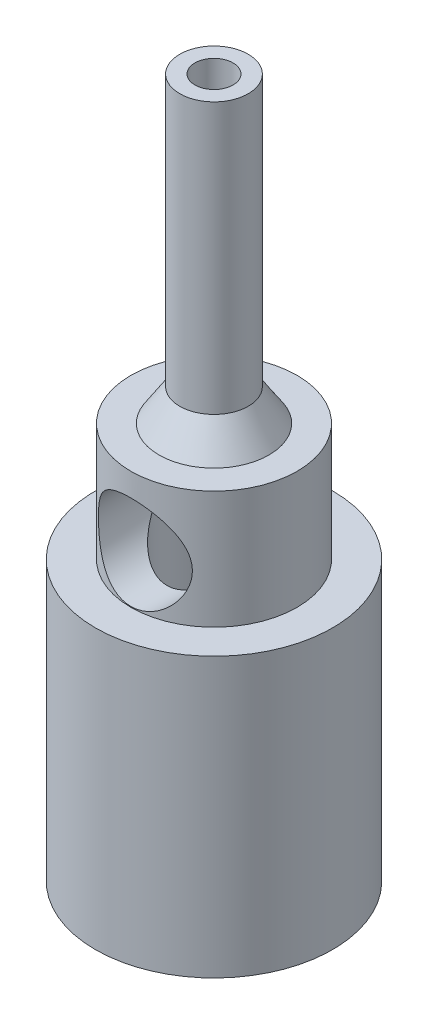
ISO-10303-21;
HEADER;
FILE_DESCRIPTION(('STEP AP214'),'2;1');
FILE_NAME('part.step','',(''),(''),'','','');
FILE_SCHEMA(('AUTOMOTIVE_DESIGN { 1 0 10303 214 1 1 1 1 }'));
ENDSEC;
DATA;
#1=APPLICATION_CONTEXT('core data for automotive mechanical design processes');
#2=APPLICATION_PROTOCOL_DEFINITION('international standard','automotive_design',2000,#1);
#3=PRODUCT_CONTEXT('',#1,'mechanical');
#4=PRODUCT('Part','Part','',(#3));
#5=PRODUCT_RELATED_PRODUCT_CATEGORY('part','',(#4));
#6=PRODUCT_DEFINITION_FORMATION('','',#4);
#7=PRODUCT_DEFINITION_CONTEXT('part definition',#1,'design');
#8=PRODUCT_DEFINITION('design','',#6,#7);
#9=PRODUCT_DEFINITION_SHAPE('','',#8);
#10=(LENGTH_UNIT() NAMED_UNIT(*) SI_UNIT(.MILLI.,.METRE.));
#11=(NAMED_UNIT(*) PLANE_ANGLE_UNIT() SI_UNIT($,.RADIAN.));
#12=(NAMED_UNIT(*) SI_UNIT($,.STERADIAN.) SOLID_ANGLE_UNIT());
#13=UNCERTAINTY_MEASURE_WITH_UNIT(LENGTH_MEASURE(1.E-05),#10,'distance_accuracy_value','');
#14=(GEOMETRIC_REPRESENTATION_CONTEXT(3) GLOBAL_UNCERTAINTY_ASSIGNED_CONTEXT((#13)) GLOBAL_UNIT_ASSIGNED_CONTEXT((#10,
#11,#12)) REPRESENTATION_CONTEXT('',''));
#15=CARTESIAN_POINT('',(0.,0.,0.));
#16=DIRECTION('',(0.,0.,1.));
#17=DIRECTION('',(1.,0.,0.));
#18=AXIS2_PLACEMENT_3D('',#15,#16,#17);
#19=CARTESIAN_POINT('',(1.2,43.9,0.));
#20=DIRECTION('',(0.,-1.,0.));
#21=DIRECTION('',(0.,0.,-1.));
#22=AXIS2_PLACEMENT_3D('',#19,#20,#21);
#23=PLANE('',#22);
#24=CARTESIAN_POINT('',(0.,43.9,0.));
#25=DIRECTION('',(0.,1.,0.));
#26=DIRECTION('',(0.,0.,1.));
#27=AXIS2_PLACEMENT_3D('',#24,#25,#26);
#28=CIRCLE('',#27,1.2);
#29=CARTESIAN_POINT('',(0.,43.9,1.2));
#30=VERTEX_POINT('',#29);
#31=EDGE_CURVE('E11',#30,#30,#28,.T.);
#32=ORIENTED_EDGE('',*,*,#31,.F.);
#33=EDGE_LOOP('',(#32));
#34=FACE_BOUND('',#33,.T.);
#35=CARTESIAN_POINT('',(0.,43.9,0.));
#36=DIRECTION('',(0.,1.,0.));
#37=DIRECTION('',(0.,0.,1.));
#38=AXIS2_PLACEMENT_3D('',#35,#36,#37);
#39=CIRCLE('',#38,2.15);
#40=CARTESIAN_POINT('',(0.,43.9,2.15));
#41=VERTEX_POINT('',#40);
#42=EDGE_CURVE('E67',#41,#41,#39,.T.);
#43=ORIENTED_EDGE('',*,*,#42,.T.);
#44=EDGE_LOOP('',(#43));
#45=FACE_BOUND('',#44,.T.);
#46=ADVANCED_FACE('F31',(#34,#45),#23,.F.);
#47=CARTESIAN_POINT('',(0.,37.9536023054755,0.));
#48=DIRECTION('',(0.,1.,0.));
#49=DIRECTION('',(0.,0.,1.));
#50=AXIS2_PLACEMENT_3D('',#47,#48,#49);
#51=CYLINDRICAL_SURFACE('',#50,1.2);
#52=CARTESIAN_POINT('',(0.,22.8366133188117,0.));
#53=DIRECTION('',(0.,1.,0.));
#54=DIRECTION('',(0.,0.,1.));
#55=AXIS2_PLACEMENT_3D('',#52,#53,#54);
#56=CIRCLE('',#55,1.2);
#57=CARTESIAN_POINT('',(0.,22.8366133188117,1.2));
#58=VERTEX_POINT('',#57);
#59=EDGE_CURVE('E116',#58,#58,#56,.T.);
#60=ORIENTED_EDGE('',*,*,#59,.F.);
#61=EDGE_LOOP('',(#60));
#62=FACE_BOUND('',#61,.T.);
#63=ORIENTED_EDGE('',*,*,#31,.T.);
#64=EDGE_LOOP('',(#63));
#65=FACE_BOUND('',#64,.T.);
#66=ADVANCED_FACE('F146',(#62,#65),#51,.F.);
#67=CARTESIAN_POINT('',(0.,37.9536023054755,0.));
#68=DIRECTION('',(0.,1.,0.));
#69=DIRECTION('',(0.,0.,1.));
#70=AXIS2_PLACEMENT_3D('',#67,#68,#69);
#71=CYLINDRICAL_SURFACE('',#70,2.95000000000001);
#72=CARTESIAN_POINT('',(0.,20.5,0.));
#73=DIRECTION('',(0.,0.707106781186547,-0.707106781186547));
#74=DIRECTION('',(0.,0.707106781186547,0.707106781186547));
#75=AXIS2_PLACEMENT_3D('',#72,#73,#74);
#76=ELLIPSE('',#75,4.17193000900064,2.95);
#77=CARTESIAN_POINT('',(2.95,20.5,0.));
#78=VERTEX_POINT('',#77);
#79=CARTESIAN_POINT('',(-2.95,20.5,0.));
#80=VERTEX_POINT('',#79);
#81=EDGE_CURVE('E56',#78,#80,#76,.T.);
#82=ORIENTED_EDGE('',*,*,#81,.T.);
#83=CARTESIAN_POINT('',(0.,20.5,0.));
#84=DIRECTION('',(0.,0.707106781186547,0.707106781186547));
#85=DIRECTION('',(0.,0.707106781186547,-0.707106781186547));
#86=AXIS2_PLACEMENT_3D('',#83,#84,#85);
#87=ELLIPSE('',#86,4.17193000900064,2.95);
#88=EDGE_CURVE('E61',#80,#78,#87,.T.);
#89=ORIENTED_EDGE('',*,*,#88,.T.);
#90=EDGE_LOOP('',(#82,#89));
#91=FACE_BOUND('',#90,.T.);
#92=CARTESIAN_POINT('',(0.,0.,0.));
#93=DIRECTION('',(0.,1.,0.));
#94=DIRECTION('',(0.,0.,1.));
#95=AXIS2_PLACEMENT_3D('',#92,#93,#94);
#96=CIRCLE('',#95,2.95000000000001);
#97=CARTESIAN_POINT('',(0.,0.,2.95000000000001));
#98=VERTEX_POINT('',#97);
#99=EDGE_CURVE('E105',#98,#98,#96,.T.);
#100=ORIENTED_EDGE('',*,*,#99,.F.);
#101=EDGE_LOOP('',(#100));
#102=FACE_BOUND('',#101,.T.);
#103=ADVANCED_FACE('F69',(#91,#102),#71,.F.);
#104=CARTESIAN_POINT('',(2.95000000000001,0.,0.));
#105=DIRECTION('',(0.,1.,0.));
#106=DIRECTION('',(0.,0.,1.));
#107=AXIS2_PLACEMENT_3D('',#104,#105,#106);
#108=PLANE('',#107);
#109=CARTESIAN_POINT('',(0.,0.,0.));
#110=DIRECTION('',(0.,1.,0.));
#111=DIRECTION('',(0.,0.,1.));
#112=AXIS2_PLACEMENT_3D('',#109,#110,#111);
#113=CIRCLE('',#112,3.45);
#114=CARTESIAN_POINT('',(0.,0.,3.45));
#115=VERTEX_POINT('',#114);
#116=EDGE_CURVE('E102',#115,#115,#113,.T.);
#117=ORIENTED_EDGE('',*,*,#116,.F.);
#118=EDGE_LOOP('',(#117));
#119=FACE_BOUND('',#118,.T.);
#120=ORIENTED_EDGE('',*,*,#99,.T.);
#121=EDGE_LOOP('',(#120));
#122=FACE_BOUND('',#121,.T.);
#123=ADVANCED_FACE('F162',(#119,#122),#108,.F.);
#124=CARTESIAN_POINT('',(0.,0.,0.));
#125=DIRECTION('',(0.,1.,0.));
#126=DIRECTION('',(0.,0.,1.));
#127=AXIS2_PLACEMENT_3D('',#124,#125,#126);
#128=CONICAL_SURFACE('',#127,3.45,0.785398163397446);
#129=CARTESIAN_POINT('',(0.,0.699999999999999,0.));
#130=DIRECTION('',(0.,1.,0.));
#131=DIRECTION('',(0.,0.,1.));
#132=AXIS2_PLACEMENT_3D('',#129,#130,#131);
#133=CIRCLE('',#132,4.15);
#134=CARTESIAN_POINT('',(0.,0.699999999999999,4.15));
#135=VERTEX_POINT('',#134);
#136=EDGE_CURVE('E99',#135,#135,#133,.T.);
#137=ORIENTED_EDGE('',*,*,#136,.F.);
#138=EDGE_LOOP('',(#137));
#139=FACE_BOUND('',#138,.T.);
#140=ORIENTED_EDGE('',*,*,#116,.T.);
#141=EDGE_LOOP('',(#140));
#142=FACE_BOUND('',#141,.T.);
#143=ADVANCED_FACE('F176',(#139,#142),#128,.T.);
#144=CARTESIAN_POINT('',(4.15,0.7,0.));
#145=DIRECTION('',(0.,1.,0.));
#146=DIRECTION('',(0.,0.,1.));
#147=AXIS2_PLACEMENT_3D('',#144,#145,#146);
#148=PLANE('',#147);
#149=CARTESIAN_POINT('',(0.,0.699999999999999,0.));
#150=DIRECTION('',(0.,1.,0.));
#151=DIRECTION('',(0.,0.,1.));
#152=AXIS2_PLACEMENT_3D('',#149,#150,#151);
#153=CIRCLE('',#152,6.1);
#154=CARTESIAN_POINT('',(0.,0.699999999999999,6.1));
#155=VERTEX_POINT('',#154);
#156=EDGE_CURVE('E96',#155,#155,#153,.T.);
#157=ORIENTED_EDGE('',*,*,#156,.F.);
#158=EDGE_LOOP('',(#157));
#159=FACE_BOUND('',#158,.T.);
#160=ORIENTED_EDGE('',*,*,#136,.T.);
#161=EDGE_LOOP('',(#160));
#162=FACE_BOUND('',#161,.T.);
#163=ADVANCED_FACE('F180',(#159,#162),#148,.F.);
#164=CARTESIAN_POINT('',(0.,37.9536023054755,0.));
#165=DIRECTION('',(0.,1.,0.));
#166=DIRECTION('',(0.,0.,1.));
#167=AXIS2_PLACEMENT_3D('',#164,#165,#166);
#168=CYLINDRICAL_SURFACE('',#167,6.1);
#169=CARTESIAN_POINT('',(0.,0.,0.));
#170=DIRECTION('',(0.,1.,0.));
#171=DIRECTION('',(0.,0.,1.));
#172=AXIS2_PLACEMENT_3D('',#169,#170,#171);
#173=CIRCLE('',#172,6.1);
#174=CARTESIAN_POINT('',(0.,0.,6.1));
#175=VERTEX_POINT('',#174);
#176=EDGE_CURVE('E93',#175,#175,#173,.T.);
#177=ORIENTED_EDGE('',*,*,#176,.F.);
#178=EDGE_LOOP('',(#177));
#179=FACE_BOUND('',#178,.T.);
#180=ORIENTED_EDGE('',*,*,#156,.T.);
#181=EDGE_LOOP('',(#180));
#182=FACE_BOUND('',#181,.T.);
#183=ADVANCED_FACE('F184',(#179,#182),#168,.F.);
#184=CARTESIAN_POINT('',(6.1,0.,0.));
#185=DIRECTION('',(0.,1.,0.));
#186=DIRECTION('',(0.,0.,1.));
#187=AXIS2_PLACEMENT_3D('',#184,#185,#186);
#188=PLANE('',#187);
#189=CARTESIAN_POINT('',(0.,0.,0.));
#190=DIRECTION('',(0.,1.,0.));
#191=DIRECTION('',(0.,0.,1.));
#192=AXIS2_PLACEMENT_3D('',#189,#190,#191);
#193=CIRCLE('',#192,7.45);
#194=CARTESIAN_POINT('',(0.,0.,7.45));
#195=VERTEX_POINT('',#194);
#196=EDGE_CURVE('E90',#195,#195,#193,.T.);
#197=ORIENTED_EDGE('',*,*,#196,.F.);
#198=EDGE_LOOP('',(#197));
#199=FACE_BOUND('',#198,.T.);
#200=ORIENTED_EDGE('',*,*,#176,.T.);
#201=EDGE_LOOP('',(#200));
#202=FACE_BOUND('',#201,.T.);
#203=ADVANCED_FACE('F188',(#199,#202),#188,.F.);
#204=CARTESIAN_POINT('',(0.,37.9536023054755,0.));
#205=DIRECTION('',(0.,1.,0.));
#206=DIRECTION('',(0.,0.,1.));
#207=AXIS2_PLACEMENT_3D('',#204,#205,#206);
#208=CYLINDRICAL_SURFACE('',#207,7.45);
#209=CARTESIAN_POINT('',(0.,17.5,0.));
#210=DIRECTION('',(0.,1.,0.));
#211=DIRECTION('',(0.,0.,1.));
#212=AXIS2_PLACEMENT_3D('',#209,#210,#211);
#213=CIRCLE('',#212,7.45);
#214=CARTESIAN_POINT('',(0.,17.5,7.45));
#215=VERTEX_POINT('',#214);
#216=EDGE_CURVE('E87',#215,#215,#213,.T.);
#217=ORIENTED_EDGE('',*,*,#216,.F.);
#218=EDGE_LOOP('',(#217));
#219=FACE_BOUND('',#218,.T.);
#220=ORIENTED_EDGE('',*,*,#196,.T.);
#221=EDGE_LOOP('',(#220));
#222=FACE_BOUND('',#221,.T.);
#223=ADVANCED_FACE('F192',(#219,#222),#208,.T.);
#224=CARTESIAN_POINT('',(5.22,17.5,0.));
#225=DIRECTION('',(0.,-1.,0.));
#226=DIRECTION('',(0.,0.,-1.));
#227=AXIS2_PLACEMENT_3D('',#224,#225,#226);
#228=PLANE('',#227);
#229=CARTESIAN_POINT('',(0.,17.5,0.));
#230=DIRECTION('',(0.,1.,0.));
#231=DIRECTION('',(0.,0.,1.));
#232=AXIS2_PLACEMENT_3D('',#229,#230,#231);
#233=CIRCLE('',#232,5.22);
#234=CARTESIAN_POINT('',(0.,17.5,5.22));
#235=VERTEX_POINT('',#234);
#236=EDGE_CURVE('E84',#235,#235,#233,.T.);
#237=ORIENTED_EDGE('',*,*,#236,.F.);
#238=EDGE_LOOP('',(#237));
#239=FACE_BOUND('',#238,.T.);
#240=ORIENTED_EDGE('',*,*,#216,.T.);
#241=EDGE_LOOP('',(#240));
#242=FACE_BOUND('',#241,.T.);
#243=ADVANCED_FACE('F141',(#239,#242),#228,.F.);
#244=CARTESIAN_POINT('',(0.,37.9536023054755,0.));
#245=DIRECTION('',(0.,1.,0.));
#246=DIRECTION('',(0.,0.,1.));
#247=AXIS2_PLACEMENT_3D('',#244,#245,#246);
#248=CYLINDRICAL_SURFACE('',#247,5.22);
#249=CARTESIAN_POINT('',(0.,17.55,5.22));
#250=CARTESIAN_POINT('',(-0.152626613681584,17.5500123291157,5.21998911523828));
#251=CARTESIAN_POINT('',(-0.30539885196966,17.5619173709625,5.21323641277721));
#252=CARTESIAN_POINT('',(-0.606072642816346,17.6089129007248,5.18689915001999));
#253=CARTESIAN_POINT('',(-0.753973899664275,17.6440047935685,5.16731381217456));
#254=CARTESIAN_POINT('',(-1.04042041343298,17.7354837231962,5.11732275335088));
#255=CARTESIAN_POINT('',(-1.17899806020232,17.7917920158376,5.08695706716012));
#256=CARTESIAN_POINT('',(-1.44445684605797,17.9235618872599,5.01804587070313));
#257=CARTESIAN_POINT('',(-1.57133506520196,17.9990282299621,4.97949832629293));
#258=CARTESIAN_POINT('',(-1.81990569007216,18.1729706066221,4.8943644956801));
#259=CARTESIAN_POINT('',(-1.94058945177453,18.2727003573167,4.84740168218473));
#260=CARTESIAN_POINT('',(-2.16448883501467,18.4895723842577,4.75165724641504));
#261=CARTESIAN_POINT('',(-2.2676858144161,18.6067329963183,4.70287374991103));
#262=CARTESIAN_POINT('',(-2.46471555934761,18.8698239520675,4.60293613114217));
#263=CARTESIAN_POINT('',(-2.55640355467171,19.0174865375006,4.55207697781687));
#264=CARTESIAN_POINT('',(-2.71325547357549,19.3290828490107,4.4603751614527));
#265=CARTESIAN_POINT('',(-2.77845858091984,19.4929920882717,4.41951773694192));
#266=CARTESIAN_POINT('',(-2.86813026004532,19.7960119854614,4.36170074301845));
#267=CARTESIAN_POINT('',(-2.89836583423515,19.9327932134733,4.34148028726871));
#268=CARTESIAN_POINT('',(-2.93910229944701,20.2104886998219,4.31401309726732));
#269=CARTESIAN_POINT('',(-2.94962362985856,20.3513985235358,4.30675292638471));
#270=CARTESIAN_POINT('',(-2.95035696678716,20.6334687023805,4.30625055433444));
#271=CARTESIAN_POINT('',(-2.94054351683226,20.774629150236,4.31302592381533));
#272=CARTESIAN_POINT('',(-2.90113096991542,21.052920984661,4.33962911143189));
#273=CARTESIAN_POINT('',(-2.87151857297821,21.1900495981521,4.35946570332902));
#274=CARTESIAN_POINT('',(-2.79403322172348,21.4566206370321,4.40952072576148));
#275=CARTESIAN_POINT('',(-2.7461999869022,21.5860790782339,4.43971656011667));
#276=CARTESIAN_POINT('',(-2.63392433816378,21.8355448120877,4.50723053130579));
#277=CARTESIAN_POINT('',(-2.56947550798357,21.9555484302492,4.54455141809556));
#278=CARTESIAN_POINT('',(-2.41408957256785,22.2026992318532,4.6292066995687));
#279=CARTESIAN_POINT('',(-2.32058257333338,22.3280107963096,4.67719333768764));
#280=CARTESIAN_POINT('',(-2.11510103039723,22.5623247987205,4.77364318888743));
#281=CARTESIAN_POINT('',(-2.00311120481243,22.6713135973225,4.82210676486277));
#282=CARTESIAN_POINT('',(-1.74907553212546,22.8818575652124,4.92031968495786));
#283=CARTESIAN_POINT('',(-1.60508529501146,22.9813139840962,4.96963528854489));
#284=CARTESIAN_POINT('',(-1.37603565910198,23.1108909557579,5.03599990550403));
#285=CARTESIAN_POINT('',(-1.29747537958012,23.150827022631,5.05685992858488));
#286=CARTESIAN_POINT('',(-1.13647009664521,23.2237343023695,5.09545554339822));
#287=CARTESIAN_POINT('',(-1.0540274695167,23.256709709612,5.11319301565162));
#288=CARTESIAN_POINT('',(-0.891711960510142,23.3132216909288,5.14388905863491));
#289=CARTESIAN_POINT('',(-0.812058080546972,23.3372546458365,5.15709392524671));
#290=CARTESIAN_POINT('',(-0.650559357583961,23.3785786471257,5.179943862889));
#291=CARTESIAN_POINT('',(-0.568715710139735,23.3958732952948,5.18959083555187));
#292=CARTESIAN_POINT('',(-0.40353614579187,23.4234674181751,5.20503885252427));
#293=CARTESIAN_POINT('',(-0.320201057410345,23.4337706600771,5.21084196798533));
#294=CARTESIAN_POINT('',(-0.152803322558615,23.4472383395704,5.21843733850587));
#295=CARTESIAN_POINT('',(-0.0687407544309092,23.4504035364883,5.22023002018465));
#296=CARTESIAN_POINT('',(0.163471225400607,23.4491789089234,5.21953250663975));
#297=CARTESIAN_POINT('',(0.311659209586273,23.4371971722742,5.21273947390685));
#298=CARTESIAN_POINT('',(0.603430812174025,23.3914055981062,5.18707832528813));
#299=CARTESIAN_POINT('',(0.747014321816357,23.3575952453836,5.16820992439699));
#300=CARTESIAN_POINT('',(1.02490376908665,23.2700425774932,5.1203228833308));
#301=CARTESIAN_POINT('',(1.15927150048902,23.2164524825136,5.09138185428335));
#302=CARTESIAN_POINT('',(1.41721605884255,23.0912505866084,5.02569835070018));
#303=CARTESIAN_POINT('',(1.54079016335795,23.0196342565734,4.98895391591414));
#304=CARTESIAN_POINT('',(1.78745045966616,22.8520216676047,4.90632666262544));
#305=CARTESIAN_POINT('',(1.90915480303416,22.7542664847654,4.85989119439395));
#306=CARTESIAN_POINT('',(2.1353752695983,22.5412866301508,4.76483615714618));
#307=CARTESIAN_POINT('',(2.23987170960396,22.4260422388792,4.71621416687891));
#308=CARTESIAN_POINT('',(2.44009908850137,22.1667494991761,4.61607387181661));
#309=CARTESIAN_POINT('',(2.53368776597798,22.0209375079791,4.56480425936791));
#310=CARTESIAN_POINT('',(2.69473699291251,21.7128464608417,4.47163167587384));
#311=CARTESIAN_POINT('',(2.76223329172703,21.5505903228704,4.42971592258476));
#312=CARTESIAN_POINT('',(2.85665822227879,21.2492574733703,4.36925150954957));
#313=CARTESIAN_POINT('',(2.88914898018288,21.1125414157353,4.34763507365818));
#314=CARTESIAN_POINT('',(2.93434215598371,20.8345335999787,4.31726832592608));
#315=CARTESIAN_POINT('',(2.94706599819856,20.6932469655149,4.30850408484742));
#316=CARTESIAN_POINT('',(2.95203230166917,20.4099000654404,4.3051037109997));
#317=CARTESIAN_POINT('',(2.94424009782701,20.2678388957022,4.31049149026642));
#318=CARTESIAN_POINT('',(2.90856552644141,19.9874018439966,4.33463813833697));
#319=CARTESIAN_POINT('',(2.88067033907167,19.8490283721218,4.35340553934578));
#320=CARTESIAN_POINT('',(2.80662201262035,19.5810328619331,4.40149632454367));
#321=CARTESIAN_POINT('',(2.76068046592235,19.4513290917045,4.43069703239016));
#322=CARTESIAN_POINT('',(2.65217565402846,19.2011214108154,4.49648553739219));
#323=CARTESIAN_POINT('',(2.58960612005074,19.0806209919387,4.53307611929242));
#324=CARTESIAN_POINT('',(2.43855243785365,18.8326258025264,4.61631539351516));
#325=CARTESIAN_POINT('',(2.34756830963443,18.7068805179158,4.66364647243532));
#326=CARTESIAN_POINT('',(2.14726151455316,18.4712737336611,4.75920367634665));
#327=CARTESIAN_POINT('',(2.03792385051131,18.3614253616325,4.80743050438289));
#328=CARTESIAN_POINT('',(1.78870553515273,18.1477823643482,4.90599859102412));
#329=CARTESIAN_POINT('',(1.64675235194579,18.0461729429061,4.95593478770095));
#330=CARTESIAN_POINT('',(1.42052374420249,17.9130522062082,5.02361998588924));
#331=CARTESIAN_POINT('',(1.34285750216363,17.8718791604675,5.04498700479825));
#332=CARTESIAN_POINT('',(1.18354238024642,17.7963946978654,5.0847170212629));
#333=CARTESIAN_POINT('',(1.10189583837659,17.7620793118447,5.10308175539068));
#334=CARTESIAN_POINT('',(0.938053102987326,17.7018013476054,5.13567874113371));
#335=CARTESIAN_POINT('',(0.855970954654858,17.6755934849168,5.15003072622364));
#336=CARTESIAN_POINT('',(0.689331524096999,17.6303710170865,5.17497001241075));
#337=CARTESIAN_POINT('',(0.604775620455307,17.6113524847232,5.18555936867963));
#338=CARTESIAN_POINT('',(0.433955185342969,17.5808046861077,5.20263770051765));
#339=CARTESIAN_POINT('',(0.347691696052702,17.5692709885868,5.20912910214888));
#340=CARTESIAN_POINT('',(0.174301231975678,17.5538656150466,5.21781308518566));
#341=CARTESIAN_POINT('',(0.0871743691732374,17.5499929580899,5.22000621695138));
#342=CARTESIAN_POINT('',(0.,17.55,5.22));
#343=B_SPLINE_CURVE_WITH_KNOTS('',3,(#249,#250,#251,#252,#253,#254,#255,#256,#257,#258,#259,
#260,#261,#262,#263,#264,#265,#266,#267,#268,#269,#270,#271,#272,#273,#274,#275,#276,#277,#278,
#279,#280,#281,#282,#283,#284,#285,#286,#287,#288,#289,#290,#291,#292,#293,#294,#295,#296,#297,
#298,#299,#300,#301,#302,#303,#304,#305,#306,#307,#308,#309,#310,#311,#312,#313,#314,#315,#316,
#317,#318,#319,#320,#321,#322,#323,#324,#325,#326,#327,#328,#329,#330,#331,#332,#333,#334,#335,
#336,#337,#338,#339,#340,#341,#342),.UNSPECIFIED.,.T.,.F.,(4,2,2,2,2,2,2,2,2,2,2,2,2,2,2,2,2,2,
2,2,2,2,2,2,2,2,2,2,2,2,2,2,2,2,2,2,2,2,2,2,2,2,2,2,2,2,4),(0.,0.457539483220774,
0.915106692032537,1.37099211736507,1.8269910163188,2.31538269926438,2.8042918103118,
3.34491005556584,3.88472552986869,4.30748963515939,4.72981518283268,5.15266974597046,
5.57580864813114,5.99803038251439,6.42041540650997,6.90910366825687,7.39819802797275,
7.94050307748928,8.21186626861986,8.48306547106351,8.73543523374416,8.98766991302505,
9.2397685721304,9.49184041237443,9.9359326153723,10.3800353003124,10.8207892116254,
11.2616539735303,11.7482764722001,12.2354517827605,12.7748795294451,13.3135655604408,
13.7382600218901,14.1624938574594,14.587444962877,15.0126673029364,15.4330460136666,
15.8535834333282,16.3384465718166,16.8237078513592,17.365334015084,17.6364058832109,
17.9073203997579,18.1689806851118,18.4304978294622,18.691860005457,18.9531887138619),.UNSPECIFIED.);
#344=CARTESIAN_POINT('',(0.,17.55,5.22));
#345=VERTEX_POINT('',#344);
#346=EDGE_CURVE('E34',#345,#345,#343,.T.);
#347=ORIENTED_EDGE('',*,*,#346,.T.);
#348=EDGE_LOOP('',(#347));
#349=FACE_BOUND('',#348,.T.);
#350=CARTESIAN_POINT('',(2.95,20.5,-4.30649509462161));
#351=CARTESIAN_POINT('',(2.94999536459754,20.6504443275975,-4.30650205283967));
#352=CARTESIAN_POINT('',(2.93841905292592,20.8009229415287,-4.31449777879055));
#353=CARTESIAN_POINT('',(2.89285973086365,21.0969567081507,-4.34516662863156));
#354=CARTESIAN_POINT('',(2.8588521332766,21.2425062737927,-4.3678558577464));
#355=CARTESIAN_POINT('',(2.7705354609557,21.5238447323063,-4.42439049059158));
#356=CARTESIAN_POINT('',(2.71635528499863,21.6596892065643,-4.45816490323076));
#357=CARTESIAN_POINT('',(2.58964139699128,21.9203106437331,-4.53294176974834));
#358=CARTESIAN_POINT('',(2.51710188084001,22.0450840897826,-4.57394650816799));
#359=CARTESIAN_POINT('',(2.34664105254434,22.2947121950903,-4.66389393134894));
#360=CARTESIAN_POINT('',(2.24683284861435,22.4181428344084,-4.71321638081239));
#361=CARTESIAN_POINT('',(2.02859350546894,22.6476571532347,-4.81119066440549));
#362=CARTESIAN_POINT('',(1.91015070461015,22.7537298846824,-4.85984205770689));
#363=CARTESIAN_POINT('',(1.64457517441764,22.9552109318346,-4.95635173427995));
#364=CARTESIAN_POINT('',(1.49580445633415,23.0487358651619,-5.00372382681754));
#365=CARTESIAN_POINT('',(1.26027396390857,23.1687087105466,-5.06623748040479));
#366=CARTESIAN_POINT('',(1.17967253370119,23.2053226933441,-5.0856563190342));
#367=CARTESIAN_POINT('',(1.01487157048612,23.2713529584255,-5.12108538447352));
#368=CARTESIAN_POINT('',(0.930674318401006,23.3007737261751,-5.13709773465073));
#369=CARTESIAN_POINT('',(0.76676715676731,23.349779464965,-5.16398704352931));
#370=CARTESIAN_POINT('',(0.687298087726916,23.3699946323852,-5.17518817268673));
#371=CARTESIAN_POINT('',(0.52658035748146,23.4037822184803,-5.19400172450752));
#372=CARTESIAN_POINT('',(0.445332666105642,23.4173581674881,-5.20161605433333));
#373=CARTESIAN_POINT('',(0.28175010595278,23.4376696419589,-5.21303471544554));
#374=CARTESIAN_POINT('',(0.199415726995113,23.4444081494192,-5.21684070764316));
#375=CARTESIAN_POINT('',(0.0344113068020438,23.4509565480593,-5.22054042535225));
#376=CARTESIAN_POINT('',(-0.0482587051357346,23.4507670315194,-5.22043448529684));
#377=CARTESIAN_POINT('',(-0.277399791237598,23.4405837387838,-5.21467827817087));
#378=CARTESIAN_POINT('',(-0.423518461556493,23.4230841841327,-5.20478273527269));
#379=CARTESIAN_POINT('',(-0.710243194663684,23.3669576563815,-5.17347263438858));
#380=CARTESIAN_POINT('',(-0.85084885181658,23.3283291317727,-5.15205723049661));
#381=CARTESIAN_POINT('',(-1.1245350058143,23.2311546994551,-5.09935537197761));
#382=CARTESIAN_POINT('',(-1.2575316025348,23.1724235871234,-5.06797733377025));
#383=CARTESIAN_POINT('',(-1.51200822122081,23.0371492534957,-4.99796768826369));
#384=CARTESIAN_POINT('',(-1.63348474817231,22.960600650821,-4.95933389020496));
#385=CARTESIAN_POINT('',(-1.87598494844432,22.7821702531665,-4.87313300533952));
#386=CARTESIAN_POINT('',(-1.99544668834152,22.6784151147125,-4.82505014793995));
#387=CARTESIAN_POINT('',(-2.21622523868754,22.4533907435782,-4.72772011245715));
#388=CARTESIAN_POINT('',(-2.31752036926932,22.3321008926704,-4.67847162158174));
#389=CARTESIAN_POINT('',(-2.50884323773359,22.0614880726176,-4.57895295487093));
#390=CARTESIAN_POINT('',(-2.59685048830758,21.9105909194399,-4.5290400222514));
#391=CARTESIAN_POINT('',(-2.74563903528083,21.5929677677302,-4.44043072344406));
#392=CARTESIAN_POINT('',(-2.80646793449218,21.4262700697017,-4.40171478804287));
#393=CARTESIAN_POINT('',(-2.88733923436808,21.1203886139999,-4.34895992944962));
#394=CARTESIAN_POINT('',(-2.91347302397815,20.9834317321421,-4.33133197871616));
#395=CARTESIAN_POINT('',(-2.94608432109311,20.7061970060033,-4.309222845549));
#396=CARTESIAN_POINT('',(-2.95257987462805,20.5659223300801,-4.3047295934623));
#397=CARTESIAN_POINT('',(-2.94556335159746,20.2860692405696,-4.30953221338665));
#398=CARTESIAN_POINT('',(-2.93204234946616,20.1464911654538,-4.31883423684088));
#399=CARTESIAN_POINT('',(-2.88574027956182,19.8719767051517,-4.34990299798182));
#400=CARTESIAN_POINT('',(-2.85294546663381,19.7370437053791,-4.37167863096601));
#401=CARTESIAN_POINT('',(-2.76895735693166,19.4729246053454,-4.42535543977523));
#402=CARTESIAN_POINT('',(-2.71749431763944,19.3438557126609,-4.45740422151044));
#403=CARTESIAN_POINT('',(-2.59794518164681,19.0956554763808,-4.52812319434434));
#404=CARTESIAN_POINT('',(-2.52985219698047,18.976528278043,-4.56679612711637));
#405=CARTESIAN_POINT('',(-2.36612227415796,18.7310675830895,-4.65400762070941));
#406=CARTESIAN_POINT('',(-2.26780523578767,18.6067221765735,-4.70312698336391));
#407=CARTESIAN_POINT('',(-2.05247660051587,18.375173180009,-4.80101763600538));
#408=CARTESIAN_POINT('',(-1.93545013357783,18.267983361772,-4.84978861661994));
#409=CARTESIAN_POINT('',(-1.6725307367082,18.0637534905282,-4.94695644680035));
#410=CARTESIAN_POINT('',(-1.52495931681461,17.968610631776,-4.99488845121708));
#411=CARTESIAN_POINT('',(-1.29103341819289,17.8460379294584,-5.05847954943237));
#412=CARTESIAN_POINT('',(-1.21093512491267,17.8085283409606,-5.07829720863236));
#413=CARTESIAN_POINT('',(-1.04706006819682,17.7406499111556,-5.11459530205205));
#414=CARTESIAN_POINT('',(-0.963285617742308,17.7102766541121,-5.13107779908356));
#415=CARTESIAN_POINT('',(-0.79973236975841,17.6592863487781,-5.15898620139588));
#416=CARTESIAN_POINT('',(-0.720190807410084,17.6380727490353,-5.17071629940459));
#417=CARTESIAN_POINT('',(-0.559220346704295,17.602317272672,-5.19059187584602));
#418=CARTESIAN_POINT('',(-0.477792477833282,17.5877718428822,-5.19873926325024));
#419=CARTESIAN_POINT('',(-0.313743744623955,17.5655649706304,-5.21121128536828));
#420=CARTESIAN_POINT('',(-0.231123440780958,17.5579003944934,-5.21553766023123));
#421=CARTESIAN_POINT('',(-0.0654464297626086,17.5495580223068,-5.22024914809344));
#422=CARTESIAN_POINT('',(0.0176102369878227,17.5488795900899,-5.22063461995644));
#423=CARTESIAN_POINT('',(0.247573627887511,17.5567387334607,-5.2161896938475));
#424=CARTESIAN_POINT('',(0.394229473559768,17.5728021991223,-5.20709906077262));
#425=CARTESIAN_POINT('',(0.682261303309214,17.6262351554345,-5.177252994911));
#426=CARTESIAN_POINT('',(0.823636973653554,17.6636059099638,-5.15649687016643));
#427=CARTESIAN_POINT('',(1.09841267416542,17.7582469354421,-5.10504909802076));
#428=CARTESIAN_POINT('',(1.2317690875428,17.8156161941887,-5.07430808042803));
#429=CARTESIAN_POINT('',(1.48715735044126,17.9482173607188,-5.00542599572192));
#430=CARTESIAN_POINT('',(1.60918593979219,18.0234543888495,-4.96728280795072));
#431=CARTESIAN_POINT('',(1.85280620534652,18.1990091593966,-4.88200084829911));
#432=CARTESIAN_POINT('',(1.97288259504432,18.3011724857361,-4.83433430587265));
#433=CARTESIAN_POINT('',(2.19515034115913,18.523004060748,-4.73755691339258));
#434=CARTESIAN_POINT('',(2.29732007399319,18.6426931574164,-4.68844439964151));
#435=CARTESIAN_POINT('',(2.49108853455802,18.9103677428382,-4.58866974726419));
#436=CARTESIAN_POINT('',(2.58062500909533,19.0599836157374,-4.53833936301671));
#437=CARTESIAN_POINT('',(2.73273636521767,19.3752178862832,-4.44841704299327));
#438=CARTESIAN_POINT('',(2.79536042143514,19.540806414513,-4.40880557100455));
#439=CARTESIAN_POINT('',(2.87802929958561,19.839081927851,-4.35512417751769));
#440=CARTESIAN_POINT('',(2.90490274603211,19.9691748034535,-4.33709543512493));
#441=CARTESIAN_POINT('',(2.94088345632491,20.232837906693,-4.3127822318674));
#442=CARTESIAN_POINT('',(2.95000411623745,20.3664054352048,-4.30648891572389));
#443=CARTESIAN_POINT('',(2.95,20.5,-4.30649509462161));
#444=B_SPLINE_CURVE_WITH_KNOTS('',3,(#350,#351,#352,#353,#354,#355,#356,#357,#358,#359,#360,
#361,#362,#363,#364,#365,#366,#367,#368,#369,#370,#371,#372,#373,#374,#375,#376,#377,#378,#379,
#380,#381,#382,#383,#384,#385,#386,#387,#388,#389,#390,#391,#392,#393,#394,#395,#396,#397,#398,
#399,#400,#401,#402,#403,#404,#405,#406,#407,#408,#409,#410,#411,#412,#413,#414,#415,#416,#417,
#418,#419,#420,#421,#422,#423,#424,#425,#426,#427,#428,#429,#430,#431,#432,#433,#434,#435,#436,
#437,#438,#439,#440,#441,#442,#443),.UNSPECIFIED.,.T.,.F.,(4,2,2,2,2,2,2,2,2,2,2,2,2,2,2,2,2,2,
2,2,2,2,2,2,2,2,2,2,2,2,2,2,2,2,2,2,2,2,2,2,2,2,2,2,2,2,4),(0.,0.450774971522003,
0.902044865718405,1.35047938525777,1.79905584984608,2.29570035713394,2.7926569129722,
3.33540681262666,3.60696242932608,3.87834827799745,4.12628590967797,4.37409155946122,
4.6217890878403,4.8694654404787,5.30964583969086,5.74985856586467,6.19424128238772,
6.63875838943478,7.13285873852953,7.6275448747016,8.16980589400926,8.7111133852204,
9.13087276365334,9.55024629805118,9.96980689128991,10.3896670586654,10.815852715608,
11.2422151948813,11.7380427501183,12.2342663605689,12.7770692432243,13.0486480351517,
13.3200583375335,13.5691690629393,13.8181468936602,14.0670112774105,14.3158529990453,
14.7569653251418,15.1981038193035,15.6414575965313,16.0849385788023,16.5770507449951,
17.0697531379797,17.6114623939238,18.1521775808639,18.5527681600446,18.9530563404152),.UNSPECIFIED.);
#445=CARTESIAN_POINT('',(2.95,20.5,-4.30649509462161));
#446=VERTEX_POINT('',#445);
#447=EDGE_CURVE('E112',#446,#446,#444,.T.);
#448=ORIENTED_EDGE('',*,*,#447,.T.);
#449=EDGE_LOOP('',(#448));
#450=FACE_BOUND('',#449,.T.);
#451=CARTESIAN_POINT('',(0.,24.9,0.));
#452=DIRECTION('',(0.,1.,0.));
#453=DIRECTION('',(0.,0.,1.));
#454=AXIS2_PLACEMENT_3D('',#451,#452,#453);
#455=CIRCLE('',#454,5.22);
#456=CARTESIAN_POINT('',(0.,24.9,5.22));
#457=VERTEX_POINT('',#456);
#458=EDGE_CURVE('E81',#457,#457,#455,.T.);
#459=ORIENTED_EDGE('',*,*,#458,.F.);
#460=EDGE_LOOP('',(#459));
#461=FACE_BOUND('',#460,.T.);
#462=ORIENTED_EDGE('',*,*,#236,.T.);
#463=EDGE_LOOP('',(#462));
#464=FACE_BOUND('',#463,.T.);
#465=ADVANCED_FACE('F117',(#349,#450,#461,#464),#248,.T.);
#466=CARTESIAN_POINT('',(3.45,24.9,0.));
#467=DIRECTION('',(0.,-1.,0.));
#468=DIRECTION('',(0.,0.,-1.));
#469=AXIS2_PLACEMENT_3D('',#466,#467,#468);
#470=PLANE('',#469);
#471=CARTESIAN_POINT('',(0.,24.9,0.));
#472=DIRECTION('',(0.,1.,0.));
#473=DIRECTION('',(0.,0.,1.));
#474=AXIS2_PLACEMENT_3D('',#471,#472,#473);
#475=CIRCLE('',#474,3.45);
#476=CARTESIAN_POINT('',(0.,24.9,3.45));
#477=VERTEX_POINT('',#476);
#478=EDGE_CURVE('E78',#477,#477,#475,.T.);
#479=ORIENTED_EDGE('',*,*,#478,.F.);
#480=EDGE_LOOP('',(#479));
#481=FACE_BOUND('',#480,.T.);
#482=ORIENTED_EDGE('',*,*,#458,.T.);
#483=EDGE_LOOP('',(#482));
#484=FACE_BOUND('',#483,.T.);
#485=ADVANCED_FACE('F134',(#481,#484),#470,.F.);
#486=CARTESIAN_POINT('',(0.,24.9,0.));
#487=DIRECTION('',(0.,-1.,0.));
#488=DIRECTION('',(0.,0.,-1.));
#489=AXIS2_PLACEMENT_3D('',#486,#487,#488);
#490=CONICAL_SURFACE('',#489,3.45,0.576375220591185);
#491=CARTESIAN_POINT('',(0.,26.9,0.));
#492=DIRECTION('',(0.,1.,0.));
#493=DIRECTION('',(0.,0.,1.));
#494=AXIS2_PLACEMENT_3D('',#491,#492,#493);
#495=CIRCLE('',#494,2.15);
#496=CARTESIAN_POINT('',(0.,26.9,2.15));
#497=VERTEX_POINT('',#496);
#498=EDGE_CURVE('E75',#497,#497,#495,.T.);
#499=ORIENTED_EDGE('',*,*,#498,.F.);
#500=EDGE_LOOP('',(#499));
#501=FACE_BOUND('',#500,.T.);
#502=ORIENTED_EDGE('',*,*,#478,.T.);
#503=EDGE_LOOP('',(#502));
#504=FACE_BOUND('',#503,.T.);
#505=ADVANCED_FACE('F131',(#501,#504),#490,.T.);
#506=CARTESIAN_POINT('',(0.,37.9536023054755,0.));
#507=DIRECTION('',(0.,1.,0.));
#508=DIRECTION('',(0.,0.,1.));
#509=AXIS2_PLACEMENT_3D('',#506,#507,#508);
#510=CYLINDRICAL_SURFACE('',#509,2.15);
#511=ORIENTED_EDGE('',*,*,#42,.F.);
#512=EDGE_LOOP('',(#511));
#513=FACE_BOUND('',#512,.T.);
#514=ORIENTED_EDGE('',*,*,#498,.T.);
#515=EDGE_LOOP('',(#514));
#516=FACE_BOUND('',#515,.T.);
#517=ADVANCED_FACE('F125',(#513,#516),#510,.T.);
#518=CARTESIAN_POINT('',(0.,20.5,-10.));
#519=DIRECTION('',(0.,0.,1.));
#520=DIRECTION('',(1.,0.,0.));
#521=AXIS2_PLACEMENT_3D('',#518,#519,#520);
#522=CYLINDRICAL_SURFACE('',#521,2.95);
#523=ORIENTED_EDGE('',*,*,#447,.F.);
#524=EDGE_LOOP('',(#523));
#525=FACE_BOUND('',#524,.T.);
#526=ORIENTED_EDGE('',*,*,#81,.F.);
#527=CARTESIAN_POINT('',(0.,20.5,0.));
#528=DIRECTION('',(0.,0.707106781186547,0.707106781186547));
#529=DIRECTION('',(0.,0.707106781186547,-0.707106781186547));
#530=AXIS2_PLACEMENT_3D('',#527,#528,#529);
#531=ELLIPSE('',#530,4.17193000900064,2.95);
#532=EDGE_CURVE('E58',#80,#78,#531,.F.);
#533=ORIENTED_EDGE('',*,*,#532,.F.);
#534=EDGE_LOOP('',(#526,#533));
#535=FACE_BOUND('',#534,.T.);
#536=ADVANCED_FACE('F57',(#525,#535),#522,.F.);
#537=ORIENTED_EDGE('',*,*,#346,.F.);
#538=EDGE_LOOP('',(#537));
#539=FACE_BOUND('',#538,.T.);
#540=CARTESIAN_POINT('',(0.,20.5,0.));
#541=DIRECTION('',(0.,0.707106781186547,-0.707106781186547));
#542=DIRECTION('',(0.,0.707106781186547,0.707106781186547));
#543=AXIS2_PLACEMENT_3D('',#540,#541,#542);
#544=ELLIPSE('',#543,4.17193000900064,2.95);
#545=EDGE_CURVE('E50',#78,#80,#544,.F.);
#546=ORIENTED_EDGE('',*,*,#545,.F.);
#547=ORIENTED_EDGE('',*,*,#88,.F.);
#548=EDGE_LOOP('',(#546,#547));
#549=FACE_BOUND('',#548,.T.);
#550=ADVANCED_FACE('F64',(#539,#549),#522,.F.);
#551=CARTESIAN_POINT('',(0.,37.9536023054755,0.));
#552=DIRECTION('',(0.,1.,0.));
#553=DIRECTION('',(0.,0.,1.));
#554=AXIS2_PLACEMENT_3D('',#551,#552,#553);
#555=CYLINDRICAL_SURFACE('',#554,2.15);
#556=CARTESIAN_POINT('',(0.,22.8366133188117,0.));
#557=DIRECTION('',(0.,1.,0.));
#558=DIRECTION('',(0.,0.,1.));
#559=AXIS2_PLACEMENT_3D('',#556,#557,#558);
#560=CIRCLE('',#559,2.15);
#561=CARTESIAN_POINT('',(0.,22.8366133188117,2.15));
#562=VERTEX_POINT('',#561);
#563=EDGE_CURVE('E281',#562,#562,#560,.T.);
#564=ORIENTED_EDGE('',*,*,#563,.T.);
#565=EDGE_LOOP('',(#564));
#566=FACE_BOUND('',#565,.T.);
#567=CARTESIAN_POINT('',(0.,23.5,0.));
#568=DIRECTION('',(0.,1.,0.));
#569=DIRECTION('',(0.,0.,1.));
#570=AXIS2_PLACEMENT_3D('',#567,#568,#569);
#571=CIRCLE('',#570,2.15);
#572=CARTESIAN_POINT('',(0.,23.5,2.15));
#573=VERTEX_POINT('',#572);
#574=EDGE_CURVE('E43',#573,#573,#571,.T.);
#575=ORIENTED_EDGE('',*,*,#574,.F.);
#576=EDGE_LOOP('',(#575));
#577=FACE_BOUND('',#576,.T.);
#578=ADVANCED_FACE('F166',(#566,#577),#555,.T.);
#579=CARTESIAN_POINT('',(2.95000000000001,23.5,0.));
#580=DIRECTION('',(0.,1.,0.));
#581=DIRECTION('',(0.,0.,1.));
#582=AXIS2_PLACEMENT_3D('',#579,#580,#581);
#583=PLANE('',#582);
#584=CARTESIAN_POINT('',(0.,23.5,0.));
#585=DIRECTION('',(0.,1.,0.));
#586=DIRECTION('',(0.,0.,1.));
#587=AXIS2_PLACEMENT_3D('',#584,#585,#586);
#588=CIRCLE('',#587,2.95000000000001);
#589=CARTESIAN_POINT('',(0.,23.5,2.95000000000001));
#590=VERTEX_POINT('',#589);
#591=EDGE_CURVE('E108',#590,#590,#588,.T.);
#592=ORIENTED_EDGE('',*,*,#591,.F.);
#593=EDGE_LOOP('',(#592));
#594=FACE_BOUND('',#593,.T.);
#595=ORIENTED_EDGE('',*,*,#574,.T.);
#596=EDGE_LOOP('',(#595));
#597=FACE_BOUND('',#596,.T.);
#598=ADVANCED_FACE('F169',(#594,#597),#583,.F.);
#599=ORIENTED_EDGE('',*,*,#591,.T.);
#600=EDGE_LOOP('',(#599));
#601=FACE_BOUND('',#600,.T.);
#602=ORIENTED_EDGE('',*,*,#545,.T.);
#603=ORIENTED_EDGE('',*,*,#532,.T.);
#604=EDGE_LOOP('',(#602,#603));
#605=FACE_BOUND('',#604,.T.);
#606=ADVANCED_FACE('F66',(#601,#605),#71,.F.);
#607=CARTESIAN_POINT('',(1.2,22.8366133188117,0.));
#608=DIRECTION('',(0.,1.,0.));
#609=DIRECTION('',(0.,0.,1.));
#610=AXIS2_PLACEMENT_3D('',#607,#608,#609);
#611=PLANE('',#610);
#612=ORIENTED_EDGE('',*,*,#59,.T.);
#613=EDGE_LOOP('',(#612));
#614=FACE_BOUND('',#613,.T.);
#615=ORIENTED_EDGE('',*,*,#563,.F.);
#616=EDGE_LOOP('',(#615));
#617=FACE_BOUND('',#616,.T.);
#618=ADVANCED_FACE('F127',(#614,#617),#611,.F.);
#619=CLOSED_SHELL('',(#46,#66,#103,#123,#143,#163,#183,#203,#223,#243,#465,#485,#505,#517,#536,
#550,#578,#598,#606,#618));
#620=MANIFOLD_SOLID_BREP('B2',#619);
#621=ADVANCED_BREP_SHAPE_REPRESENTATION('',(#18,#620),#14);
#622=SHAPE_DEFINITION_REPRESENTATION(#9,#621);
ENDSEC;
END-ISO-10303-21;
